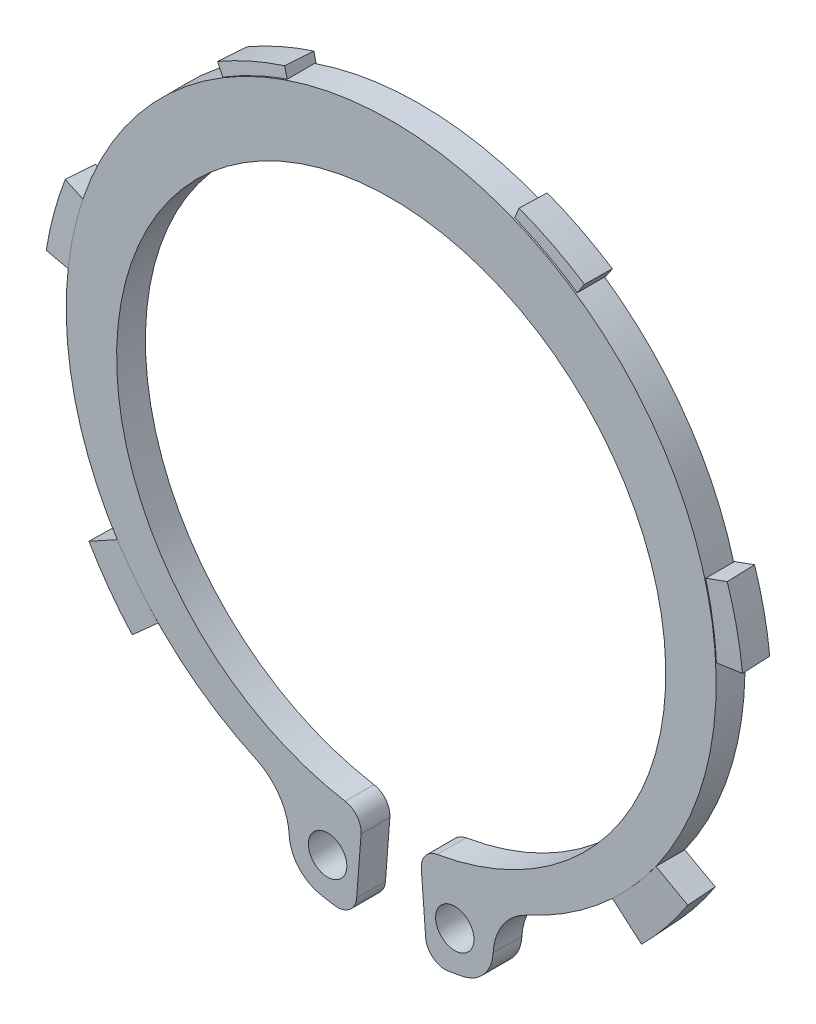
from build123d import *

# Parameters (mm, degrees)
ESQUISSE1_R                  = 1
BASE_EXTRUSION_DEPTH         = 1.5
R_VOLUTION1_ANGLE            = 12
R_P_TITION_CIRCULAIRE2_COUNT = 6
R_P_TITION_CIRCULAIRE2_ANGLE = 255
CONG_1_R                     = 1


with BuildPart() as part:
    # Esquisse1 → Base-Extrusion (new body)
    with BuildSketch(Plane.XY):
        with BuildLine():
            Line((1.496865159, -14.221441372), (1.877447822, -19.206936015))
            ThreePointArc((1.877447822, -19.206936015), (2.789337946, -19.095831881), (3.69490774, -18.941458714))
            ThreePointArc((3.69490774, -18.941458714), (4.822315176, -18.289528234), (5.309319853, -17.081684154))
            ThreePointArc((5.309319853, -17.081684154), (5.822961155, -15.551919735), (7.054833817, -14.509568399))
            ThreePointArc((7.054833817, -14.509568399), (0, 17.8), (-7.054833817, -14.509568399))
            ThreePointArc((-7.054833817, -14.509568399), (-5.822961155, -15.551919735), (-5.309319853, -17.081684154))
            ThreePointArc((-5.309319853, -17.081684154), (-4.822315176, -18.289528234), (-3.69490774, -18.941458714))
            ThreePointArc((-3.69490774, -18.941458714), (-2.789337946, -19.095831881), (-1.877447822, -19.206936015))
            Line((-1.877447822, -19.206936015), (-1.496865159, -14.221441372))
            ThreePointArc((-1.496865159, -14.221441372), (0, 14.3), (1.496865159, -14.221441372))
        make_face()
        with Locations((3.311985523, -16.978458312)):
            Circle(ESQUISSE1_R, mode=Mode.SUBTRACT)
        with Locations(Location((-3.311985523, -16.978458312, 0), (0, 0, 180))):
            Circle(ESQUISSE1_R, mode=Mode.SUBTRACT)
    extrude(amount=BASE_EXTRUSION_DEPTH)

    # Esquisse2 → R_volution1 (revolve)
    with BuildSketch(Plane(origin=(0, 0, 0), x_dir=(-0.7071067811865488, 0.7071067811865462, 0), z_dir=(0.7071067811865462, 0.7071067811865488, 0))):
        Polygon((-16.294968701, 1.5), (-18.292259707, 1.395939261), (-18.214319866, -0.1), (-16.294968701, 0), align=None)
    r_volution1 = revolve(axis=Axis((0, 0, 0), (0, 0, 1)), revolution_arc=R_VOLUTION1_ANGLE)

    # R_p_tition circulaire2: R_volution1 ×6 about axis
    r_p_tition_circulaire2_axis = Axis((0, 0, 0), (0, 0, 1))
    for i in range(1, R_P_TITION_CIRCULAIRE2_COUNT):
        add(r_volution1.rotate(r_p_tition_circulaire2_axis, i * R_P_TITION_CIRCULAIRE2_ANGLE / (R_P_TITION_CIRCULAIRE2_COUNT - 1)))

    # Cong_1
    cong_1_edges = [part.edges().sort_by_distance(p)[0] for p in [
        (-1.496865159, -14.221441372, 0.75),
        (-1.877447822, -19.206936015, 0.75),
        (1.877447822, -19.206936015, 0.75),
        (1.496865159, -14.221441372, 0.75),
    ]]
    fillet(cong_1_edges, radius=CONG_1_R)


solid = part.part
